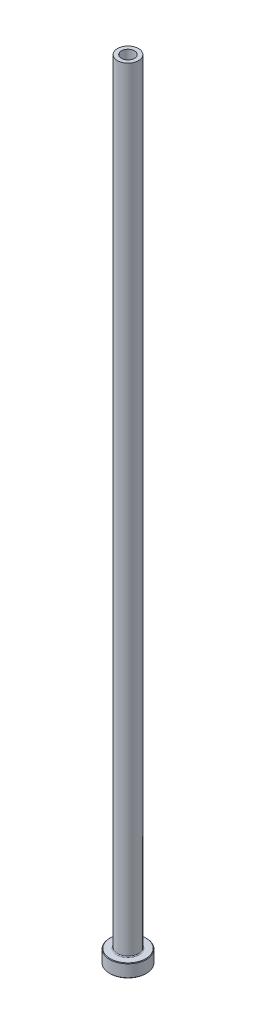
from build123d import *

# Parameters (mm, degrees)
FILLET1_R     = 0.3
CHAMFER1_SIZE = 0.2
CHAMFER3_SIZE = 0.5


with BuildPart() as part:
    # Sketch1 → Revolve1 (revolve)
    with BuildSketch(Plane.XY, mode=Mode.PRIVATE) as revolve1_sk:
        Polygon((-2.5, 300), (-4, 300), (-4, 5), (-7, 5), (-7, 0), (-2.75, 0), (-2.75, 243), (-2.5, 255), align=None)
    revolve(revolve1_sk.sketch.rotate(Axis((0, 92.187680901, 0), (0, -1, 0)), 270), axis=Axis((0, 92.187680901, 0), (0, -1, 0)))

    # Fillet1
    fillet1_edges = [part.edges().sort_by_distance(p)[0] for p in [
        (0, 5, -4),
    ]]
    fillet(fillet1_edges, radius=FILLET1_R)

    # Chamfer1
    chamfer1_edges = [part.edges().sort_by_distance(p)[0] for p in [
        (0, 0, -7),
        (0, 5, -7),
    ]]
    chamfer(chamfer1_edges, length=CHAMFER1_SIZE)

    # Chamfer3
    chamfer3_edges = [part.edges().sort_by_distance(p)[0] for p in [
        (0, 0, -2.75),
    ]]
    chamfer(chamfer3_edges, length=CHAMFER3_SIZE)


solid = part.part
